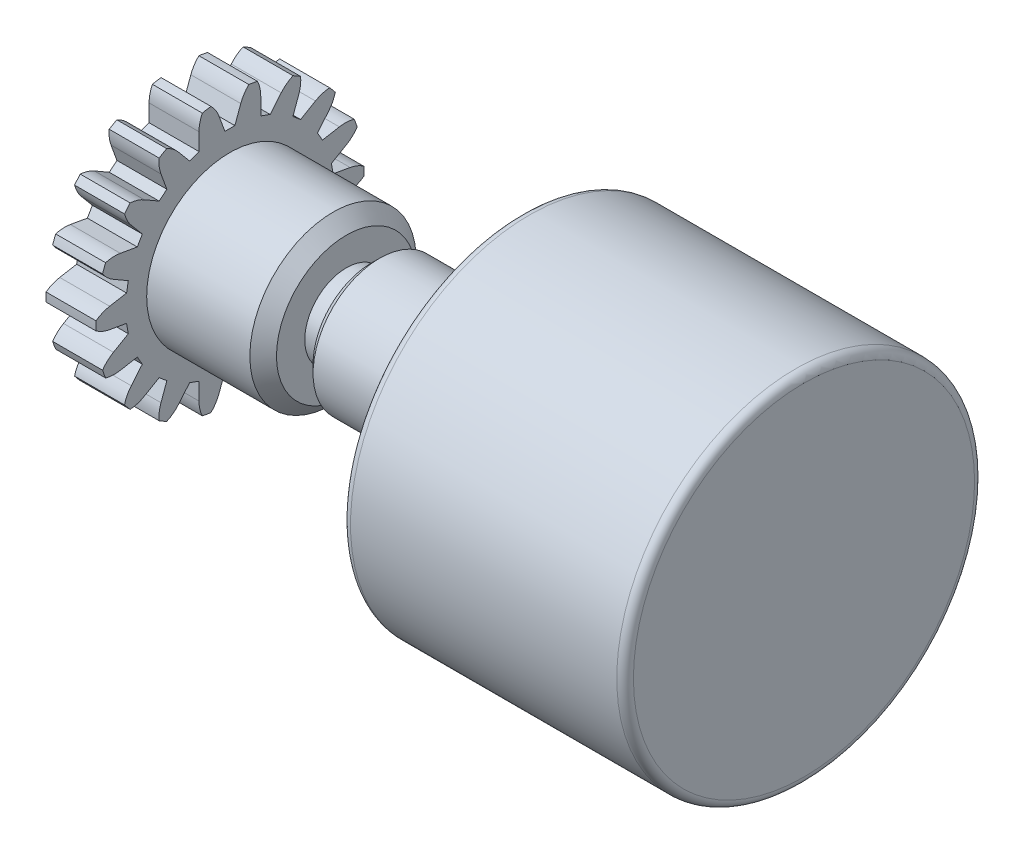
from build123d import *

# Parameters (mm, degrees)
ENL_V_MAT_EXTRU_1_DEPTH      = 16.152722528
R_P_TITION_CIRCULAIRE1_COUNT = 18
CHANFREIN1_SIZE              = 0.8
ESQUISSE4_R                  = 2.5
BOSS_EXTRU_1_DEPTH           = 1.5
ESQUISSE5_R                  = 4
BOSS_EXTRU_2_DEPTH           = 9
ESQUISSE6_R                  = 10.75
BOSS_EXTRU_3_DEPTH           = 17
CHANFREIN2_SIZE              = 0.5
CONG_1_R                     = 0.5
ESQUISSE7_R                  = 6
ESQUISSE7_R_2                = 4
EXTRU_MINCE1_DEPTH           = 0.5


with BuildPart() as part:
    # Esquisse1 → R_volution1 (revolve)
    with BuildSketch(Plane.XY, mode=Mode.PRIVATE) as r_volution1_sk:
        Polygon((0, 0), (0, 8.05), (3, 8.05), (3, 5), (10, 5), (10, 0), align=None)
    revolve(r_volution1_sk.sketch.rotate(Axis((-19.448313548, 0, 0), (1, 0, 0)), 90), axis=Axis((-19.448313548, 0, 0), (1, 0, 0)))

    # Esquisse2 → Enl_v. mat.-Extru.1 (cut, through all)
    with BuildSketch(Plane.ZY):
        with BuildLine():
            Line((-2.533478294, 8.536396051), (2.532592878, 8.536470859))
            ThreePointArc((2.532592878, 8.536470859), (1.385457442, 8.174766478), (0.653237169, 7.220511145))
            Line((0.653237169, 7.220511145), (0.3, 6.25))
            Line((0.3, 6.25), (-0.300853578, 6.25))
            Line((-0.300853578, 6.25), (-0.65406352, 7.220436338))
            ThreePointArc((-0.65406352, 7.220436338), (-1.386307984, 8.17470861), (-2.533478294, 8.536396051))
        make_face()
    enl_v_mat_extru_1 = extrude(amount=-ENL_V_MAT_EXTRU_1_DEPTH, mode=Mode.SUBTRACT)

    # R_p_tition circulaire1: Enl_v. mat.-Extru.1 ×18 about axis
    r_p_tition_circulaire1_axis = Axis((0, 0, 0), (1, 0, 0))
    for i in range(1, R_P_TITION_CIRCULAIRE1_COUNT):
        add(enl_v_mat_extru_1.rotate(r_p_tition_circulaire1_axis, i * 360 / R_P_TITION_CIRCULAIRE1_COUNT), mode=Mode.SUBTRACT)

    # Chanfrein1
    chanfrein1_edges = [part.edges().sort_by_distance(p)[0] for p in [
        (10, 0, -5),
    ]]
    chamfer(chanfrein1_edges, length=CHANFREIN1_SIZE)

    # Esquisse4 → Boss.-Extru.1 (add)
    with BuildSketch(Plane(origin=(10, 0, 0), x_dir=(0, 0, -1), z_dir=(1, 0, 0))):
        with Locations(Location((0, 0, 0), (0, 0, 180))):
            Circle(ESQUISSE4_R)
    extrude(amount=BOSS_EXTRU_1_DEPTH)

    # Esquisse5 → Boss.-Extru.2 (add)
    with BuildSketch(Plane(origin=(11.5, 0, 0), x_dir=(0, 0, -1), z_dir=(1, 0, 0))):
        Circle(ESQUISSE5_R)
    extrude(amount=BOSS_EXTRU_2_DEPTH)

    # Esquisse6 → Boss.-Extru.3 (add)
    with BuildSketch(Plane(origin=(20.5, 0, 0), x_dir=(0, 0, -1), z_dir=(1, 0, 0))):
        Circle(ESQUISSE6_R)
    extrude(amount=BOSS_EXTRU_3_DEPTH)

    # Chanfrein2
    chanfrein2_edges = [part.edges().sort_by_distance(p)[0] for p in [
        (11.5, 0, 4),
    ]]
    chamfer(chanfrein2_edges, length=CHANFREIN2_SIZE)

    # Cong_1
    cong_1_edges = [part.edges().sort_by_distance(p)[0] for p in [
        (20.5, 0, 10.75),
        (37.5, 0, 10.75),
    ]]
    fillet(cong_1_edges, radius=CONG_1_R)


with BuildPart() as body_2:
    # Esquisse7 → Extru.-Mince1 (new body)
    with BuildSketch(Plane.ZY.offset(-20.5)):
        Circle(ESQUISSE7_R)
        Circle(ESQUISSE7_R_2, mode=Mode.SUBTRACT)
    extrude(amount=EXTRU_MINCE1_DEPTH)


solid = Compound([part.part, body_2.part])
